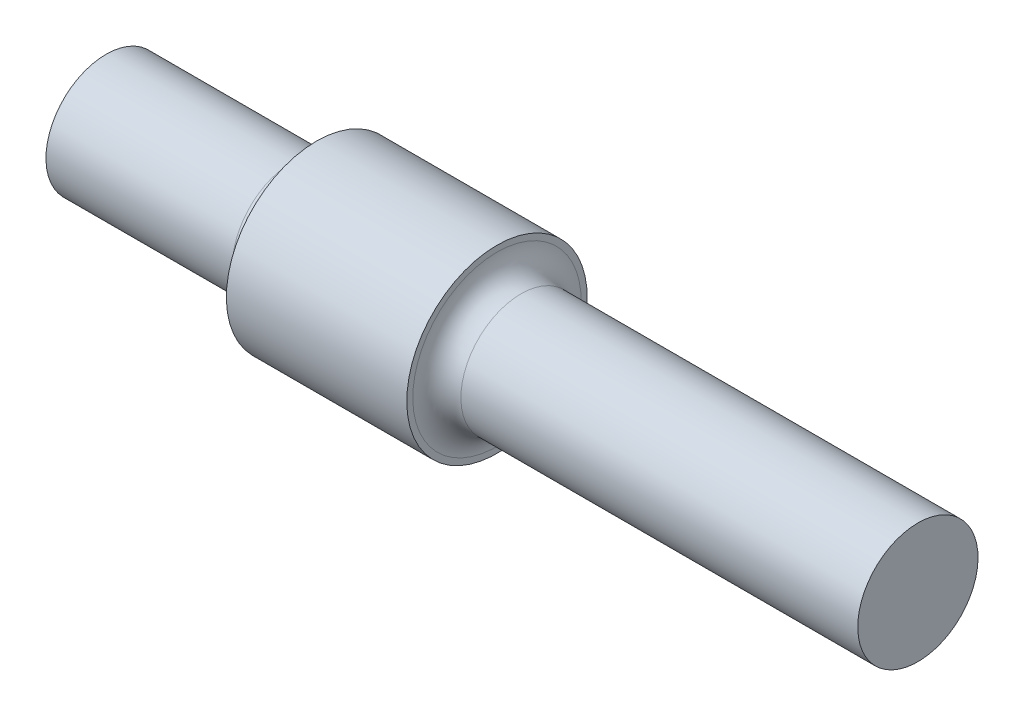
ISO-10303-21;
HEADER;
FILE_DESCRIPTION(('STEP AP214'),'2;1');
FILE_NAME('part.step','',(''),(''),'','','');
FILE_SCHEMA(('AUTOMOTIVE_DESIGN { 1 0 10303 214 1 1 1 1 }'));
ENDSEC;
DATA;
#1=APPLICATION_CONTEXT('core data for automotive mechanical design processes');
#2=APPLICATION_PROTOCOL_DEFINITION('international standard','automotive_design',2000,#1);
#3=PRODUCT_CONTEXT('',#1,'mechanical');
#4=PRODUCT('Part','Part','',(#3));
#5=PRODUCT_RELATED_PRODUCT_CATEGORY('part','',(#4));
#6=PRODUCT_DEFINITION_FORMATION('','',#4);
#7=PRODUCT_DEFINITION_CONTEXT('part definition',#1,'design');
#8=PRODUCT_DEFINITION('design','',#6,#7);
#9=PRODUCT_DEFINITION_SHAPE('','',#8);
#10=(LENGTH_UNIT() NAMED_UNIT(*) SI_UNIT(.MILLI.,.METRE.));
#11=(NAMED_UNIT(*) PLANE_ANGLE_UNIT() SI_UNIT($,.RADIAN.));
#12=(NAMED_UNIT(*) SI_UNIT($,.STERADIAN.) SOLID_ANGLE_UNIT());
#13=UNCERTAINTY_MEASURE_WITH_UNIT(LENGTH_MEASURE(1.E-05),#10,'distance_accuracy_value','');
#14=(GEOMETRIC_REPRESENTATION_CONTEXT(3) GLOBAL_UNCERTAINTY_ASSIGNED_CONTEXT((#13)) GLOBAL_UNIT_ASSIGNED_CONTEXT((#10,
#11,#12)) REPRESENTATION_CONTEXT('',''));
#15=CARTESIAN_POINT('',(0.,0.,0.));
#16=DIRECTION('',(0.,0.,1.));
#17=DIRECTION('',(1.,0.,0.));
#18=AXIS2_PLACEMENT_3D('',#15,#16,#17);
#19=CARTESIAN_POINT('',(135.,15.,0.));
#20=DIRECTION('',(1.,0.,0.));
#21=DIRECTION('',(0.,1.,0.));
#22=AXIS2_PLACEMENT_3D('',#19,#20,#21);
#23=CYLINDRICAL_SURFACE('',#22,15.);
#24=CARTESIAN_POINT('',(35.,15.,0.));
#25=DIRECTION('',(1.,0.,0.));
#26=DIRECTION('',(0.,1.,0.));
#27=AXIS2_PLACEMENT_3D('',#24,#25,#26);
#28=CIRCLE('',#27,15.);
#29=CARTESIAN_POINT('',(35.,30.,0.));
#30=VERTEX_POINT('',#29);
#31=EDGE_CURVE('E100',#30,#30,#28,.T.);
#32=ORIENTED_EDGE('',*,*,#31,.T.);
#33=EDGE_LOOP('',(#32));
#34=FACE_BOUND('',#33,.T.);
#35=CARTESIAN_POINT('',(65.,15.,0.));
#36=DIRECTION('',(1.,0.,0.));
#37=DIRECTION('',(0.,1.,0.));
#38=AXIS2_PLACEMENT_3D('',#35,#36,#37);
#39=CIRCLE('',#38,15.);
#40=CARTESIAN_POINT('',(65.,30.,0.));
#41=VERTEX_POINT('',#40);
#42=EDGE_CURVE('E92',#41,#41,#39,.T.);
#43=ORIENTED_EDGE('',*,*,#42,.F.);
#44=EDGE_LOOP('',(#43));
#45=FACE_BOUND('',#44,.T.);
#46=DIRECTION('',(1.,0.,0.));
#47=VECTOR('',#46,1.);
#48=CARTESIAN_POINT('',(135.,0.20980054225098,-2.5));
#49=LINE('',#48,#47);
#50=CARTESIAN_POINT('',(57.5,0.209800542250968,-2.5));
#51=VERTEX_POINT('',#50);
#52=CARTESIAN_POINT('',(42.5,0.209800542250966,-2.5));
#53=VERTEX_POINT('',#52);
#54=EDGE_CURVE('E11',#51,#53,#49,.F.);
#55=ORIENTED_EDGE('',*,*,#54,.T.);
#56=CARTESIAN_POINT('',(42.5,0.209800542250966,-2.5));
#57=CARTESIAN_POINT('',(42.4302056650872,0.209805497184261,-2.50000730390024));
#58=CARTESIAN_POINT('',(42.360415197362,0.209306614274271,-2.4970773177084));
#59=CARTESIAN_POINT('',(42.2213432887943,0.207337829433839,-2.4853993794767));
#60=CARTESIAN_POINT('',(42.1520617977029,0.205868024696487,-2.47665200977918));
#61=CARTESIAN_POINT('',(42.0145824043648,0.201996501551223,-2.45341067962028));
#62=CARTESIAN_POINT('',(41.9463832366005,0.199595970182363,-2.43892403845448));
#63=CARTESIAN_POINT('',(41.811482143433,0.193936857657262,-2.40432916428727));
#64=CARTESIAN_POINT('',(41.7447802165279,0.190678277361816,-2.38422093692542));
#65=CARTESIAN_POINT('',(41.5475936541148,0.179745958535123,-2.31565228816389));
#66=CARTESIAN_POINT('',(41.4199350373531,0.170912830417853,-2.25893203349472));
#67=CARTESIAN_POINT('',(41.1760128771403,0.1511582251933,-2.12519086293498));
#68=CARTESIAN_POINT('',(41.0597494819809,0.140236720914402,-2.04816968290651));
#69=CARTESIAN_POINT('',(40.8406979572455,0.11741594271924,-1.87519305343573));
#70=CARTESIAN_POINT('',(40.7380360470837,0.105508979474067,-1.77907849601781));
#71=CARTESIAN_POINT('',(40.5502132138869,0.0821262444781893,-1.57098216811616));
#72=CARTESIAN_POINT('',(40.465054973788,0.0706505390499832,-1.45899796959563));
#73=CARTESIAN_POINT('',(40.314183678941,0.0493423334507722,-1.2215195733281));
#74=CARTESIAN_POINT('',(40.2485893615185,0.0395200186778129,-1.09594894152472));
#75=CARTESIAN_POINT('',(40.1394763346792,0.0227122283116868,-0.83538789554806));
#76=CARTESIAN_POINT('',(40.0959549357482,0.0157264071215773,-0.700398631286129));
#77=CARTESIAN_POINT('',(40.0326078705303,0.00543271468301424,-0.426145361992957));
#78=CARTESIAN_POINT('',(40.0125675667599,0.002091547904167,-0.286932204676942));
#79=CARTESIAN_POINT('',(39.9960841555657,-0.000650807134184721,-0.00707863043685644));
#80=CARTESIAN_POINT('',(39.9996400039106,-5.2169746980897E-05,0.13356172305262));
#81=CARTESIAN_POINT('',(40.0300813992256,0.00499142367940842,0.410802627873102));
#82=CARTESIAN_POINT('',(40.0567353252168,0.00939819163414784,0.547429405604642));
#83=CARTESIAN_POINT('',(40.1322513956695,0.0215202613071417,0.814242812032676));
#84=CARTESIAN_POINT('',(40.1811140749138,0.0292356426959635,0.944429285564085));
#85=CARTESIAN_POINT('',(40.2998917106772,0.0471731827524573,1.19535848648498));
#86=CARTESIAN_POINT('',(40.3699024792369,0.057406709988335,1.31605501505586));
#87=CARTESIAN_POINT('',(40.5289162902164,0.0792430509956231,1.54406954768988));
#88=CARTESIAN_POINT('',(40.6179201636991,0.0908459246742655,1.65138696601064));
#89=CARTESIAN_POINT('',(40.8136646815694,0.114295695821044,1.85095740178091));
#90=CARTESIAN_POINT('',(40.9206055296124,0.126143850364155,1.94301399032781));
#91=CARTESIAN_POINT('',(41.1485556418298,0.148617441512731,2.10793451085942));
#92=CARTESIAN_POINT('',(41.2695689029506,0.159242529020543,2.18079297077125));
#93=CARTESIAN_POINT('',(41.5224736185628,0.178069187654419,2.30528815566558));
#94=CARTESIAN_POINT('',(41.6543831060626,0.18626663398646,2.35688881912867));
#95=CARTESIAN_POINT('',(41.9250742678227,0.199244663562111,2.43707184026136));
#96=CARTESIAN_POINT('',(42.0638453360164,0.20403035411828,2.46568861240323));
#97=CARTESIAN_POINT('',(42.2530597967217,0.207821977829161,2.48826986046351));
#98=CARTESIAN_POINT('',(42.3023859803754,0.208563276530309,2.49267049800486));
#99=CARTESIAN_POINT('',(42.4011342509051,0.209552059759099,2.49853173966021));
#100=CARTESIAN_POINT('',(42.4505560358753,0.209800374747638,2.49999728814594));
#101=CARTESIAN_POINT('',(42.5,0.209800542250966,2.5));
#102=B_SPLINE_CURVE_WITH_KNOTS('',3,(#56,#57,#58,#59,#60,#61,#62,#63,#64,#65,#66,#67,#68,#69,
#70,#71,#72,#73,#74,#75,#76,#77,#78,#79,#80,#81,#82,#83,#84,#85,#86,#87,#88,#89,#90,#91,#92,#93,
#94,#95,#96,#97,#98,#99,#100,#101),.UNSPECIFIED.,.F.,.F.,(4,2,2,2,2,2,2,2,2,2,2,2,2,2,2,2,2,2,2,
2,2,2,4),(0.,0.209312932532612,0.418604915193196,0.627630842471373,0.836656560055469,
1.25442781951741,1.67220451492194,2.09362084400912,2.51510171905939,2.93909089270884,
3.36302839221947,3.78305973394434,4.20307248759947,4.61892157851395,5.03478068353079,
5.45255285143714,5.87034330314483,6.29315203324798,6.71608114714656,7.13972478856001,
7.56273290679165,7.71124858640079,7.85951386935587),.UNSPECIFIED.);
#103=CARTESIAN_POINT('',(42.5,0.209800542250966,2.5));
#104=VERTEX_POINT('',#103);
#105=EDGE_CURVE('E118',#53,#104,#102,.T.);
#106=ORIENTED_EDGE('',*,*,#105,.T.);
#107=DIRECTION('',(1.,0.,0.));
#108=VECTOR('',#107,1.);
#109=CARTESIAN_POINT('',(135.,0.209800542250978,2.5));
#110=LINE('',#109,#108);
#111=CARTESIAN_POINT('',(57.5,0.209800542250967,2.5));
#112=VERTEX_POINT('',#111);
#113=EDGE_CURVE('E41',#104,#112,#110,.T.);
#114=ORIENTED_EDGE('',*,*,#113,.T.);
#115=CARTESIAN_POINT('',(57.5,0.209800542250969,2.5));
#116=CARTESIAN_POINT('',(57.5697943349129,0.209805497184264,2.50000730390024));
#117=CARTESIAN_POINT('',(57.639584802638,0.209306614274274,2.4970773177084));
#118=CARTESIAN_POINT('',(57.7786567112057,0.207337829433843,2.4853993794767));
#119=CARTESIAN_POINT('',(57.8479382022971,0.20586802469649,2.47665200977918));
#120=CARTESIAN_POINT('',(57.9854175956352,0.201996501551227,2.45341067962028));
#121=CARTESIAN_POINT('',(58.0536167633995,0.199595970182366,2.43892403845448));
#122=CARTESIAN_POINT('',(58.188517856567,0.193936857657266,2.40432916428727));
#123=CARTESIAN_POINT('',(58.2552197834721,0.19067827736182,2.38422093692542));
#124=CARTESIAN_POINT('',(58.4524063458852,0.179745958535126,2.31565228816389));
#125=CARTESIAN_POINT('',(58.5800649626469,0.170912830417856,2.25893203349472));
#126=CARTESIAN_POINT('',(58.8239871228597,0.151158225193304,2.12519086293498));
#127=CARTESIAN_POINT('',(58.9402505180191,0.140236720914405,2.04816968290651));
#128=CARTESIAN_POINT('',(59.1593020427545,0.117415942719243,1.87519305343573));
#129=CARTESIAN_POINT('',(59.2619639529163,0.105508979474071,1.77907849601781));
#130=CARTESIAN_POINT('',(59.4497867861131,0.0821262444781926,1.57098216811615));
#131=CARTESIAN_POINT('',(59.534945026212,0.0706505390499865,1.45899796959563));
#132=CARTESIAN_POINT('',(59.685816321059,0.0493423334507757,1.2215195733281));
#133=CARTESIAN_POINT('',(59.7514106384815,0.0395200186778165,1.09594894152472));
#134=CARTESIAN_POINT('',(59.8605236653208,0.0227122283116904,0.835387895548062));
#135=CARTESIAN_POINT('',(59.9040450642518,0.0157264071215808,0.70039863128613));
#136=CARTESIAN_POINT('',(59.9673921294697,0.0054327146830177,0.426145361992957));
#137=CARTESIAN_POINT('',(59.9874324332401,0.00209154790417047,0.286932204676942));
#138=CARTESIAN_POINT('',(60.0039158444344,-0.000650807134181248,0.00707863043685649));
#139=CARTESIAN_POINT('',(60.0003599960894,-5.21697469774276E-05,-0.13356172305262));
#140=CARTESIAN_POINT('',(59.9699186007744,0.00499142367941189,-0.410802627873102));
#141=CARTESIAN_POINT('',(59.9432646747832,0.00939819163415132,-0.547429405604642));
#142=CARTESIAN_POINT('',(59.8677486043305,0.0215202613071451,-0.814242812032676));
#143=CARTESIAN_POINT('',(59.8188859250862,0.029235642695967,-0.944429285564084));
#144=CARTESIAN_POINT('',(59.7001082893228,0.0471731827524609,-1.19535848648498));
#145=CARTESIAN_POINT('',(59.6300975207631,0.0574067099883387,-1.31605501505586));
#146=CARTESIAN_POINT('',(59.4710837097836,0.0792430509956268,-1.54406954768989));
#147=CARTESIAN_POINT('',(59.3820798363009,0.0908459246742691,-1.65138696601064));
#148=CARTESIAN_POINT('',(59.1863353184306,0.114295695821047,-1.85095740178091));
#149=CARTESIAN_POINT('',(59.0793944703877,0.126143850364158,-1.94301399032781));
#150=CARTESIAN_POINT('',(58.8514443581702,0.148617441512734,-2.10793451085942));
#151=CARTESIAN_POINT('',(58.7304310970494,0.159242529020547,-2.18079297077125));
#152=CARTESIAN_POINT('',(58.4775263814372,0.178069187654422,-2.30528815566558));
#153=CARTESIAN_POINT('',(58.3456168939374,0.186266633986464,-2.35688881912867));
#154=CARTESIAN_POINT('',(58.0749257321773,0.199244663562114,-2.43707184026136));
#155=CARTESIAN_POINT('',(57.9361546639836,0.204030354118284,-2.46568861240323));
#156=CARTESIAN_POINT('',(57.7469402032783,0.207821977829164,-2.48826986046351));
#157=CARTESIAN_POINT('',(57.6976140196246,0.208563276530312,-2.49267049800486));
#158=CARTESIAN_POINT('',(57.5988657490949,0.209552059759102,-2.49853173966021));
#159=CARTESIAN_POINT('',(57.5494439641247,0.209800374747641,-2.49999728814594));
#160=CARTESIAN_POINT('',(57.5,0.209800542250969,-2.5));
#161=B_SPLINE_CURVE_WITH_KNOTS('',3,(#115,#116,#117,#118,#119,#120,#121,#122,#123,#124,#125,
#126,#127,#128,#129,#130,#131,#132,#133,#134,#135,#136,#137,#138,#139,#140,#141,#142,#143,#144,
#145,#146,#147,#148,#149,#150,#151,#152,#153,#154,#155,#156,#157,#158,#159,#160),.UNSPECIFIED.,
.F.,.F.,(4,2,2,2,2,2,2,2,2,2,2,2,2,2,2,2,2,2,2,2,2,2,4),(0.,0.209312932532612,0.418604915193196,
0.627630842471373,0.836656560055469,1.25442781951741,1.67220451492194,2.09362084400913,
2.51510171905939,2.93909089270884,3.36302839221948,3.78305973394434,4.20307248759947,
4.61892157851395,5.03478068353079,5.45255285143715,5.87034330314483,6.29315203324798,
6.71608114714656,7.13972478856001,7.56273290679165,7.7112485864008,7.85951386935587),.UNSPECIFIED.);
#162=EDGE_CURVE('E48',#112,#51,#161,.T.);
#163=ORIENTED_EDGE('',*,*,#162,.T.);
#164=EDGE_LOOP('',(#55,#106,#114,#163));
#165=FACE_BOUND('',#164,.T.);
#166=ADVANCED_FACE('F33',(#34,#45,#165),#23,.T.);
#167=CARTESIAN_POINT('',(0.,15.,0.));
#168=DIRECTION('',(-1.,0.,0.));
#169=DIRECTION('',(0.,-1.,0.));
#170=AXIS2_PLACEMENT_3D('',#167,#168,#169);
#171=PLANE('',#170);
#172=CARTESIAN_POINT('',(0.,15.,0.));
#173=DIRECTION('',(1.,0.,0.));
#174=DIRECTION('',(0.,1.,0.));
#175=AXIS2_PLACEMENT_3D('',#172,#173,#174);
#176=CIRCLE('',#175,10.);
#177=CARTESIAN_POINT('',(0.,25.,0.));
#178=VERTEX_POINT('',#177);
#179=EDGE_CURVE('E103',#178,#178,#176,.T.);
#180=ORIENTED_EDGE('',*,*,#179,.F.);
#181=EDGE_LOOP('',(#180));
#182=FACE_BOUND('',#181,.T.);
#183=ADVANCED_FACE('F166',(#182),#171,.T.);
#184=CARTESIAN_POINT('',(135.,15.,0.));
#185=DIRECTION('',(1.,0.,0.));
#186=DIRECTION('',(0.,1.,0.));
#187=AXIS2_PLACEMENT_3D('',#184,#185,#186);
#188=CYLINDRICAL_SURFACE('',#187,10.);
#189=CARTESIAN_POINT('',(31.,15.,0.));
#190=DIRECTION('',(-1.,0.,0.));
#191=DIRECTION('',(0.,-1.,0.));
#192=AXIS2_PLACEMENT_3D('',#189,#190,#191);
#193=CIRCLE('',#192,10.);
#194=CARTESIAN_POINT('',(31.,5.,0.));
#195=VERTEX_POINT('',#194);
#196=EDGE_CURVE('E115',#195,#195,#193,.T.);
#197=ORIENTED_EDGE('',*,*,#196,.T.);
#198=EDGE_LOOP('',(#197));
#199=FACE_BOUND('',#198,.T.);
#200=ORIENTED_EDGE('',*,*,#179,.T.);
#201=EDGE_LOOP('',(#200));
#202=FACE_BOUND('',#201,.T.);
#203=ADVANCED_FACE('F162',(#199,#202),#188,.T.);
#204=CARTESIAN_POINT('',(35.,25.,0.));
#205=DIRECTION('',(-1.,0.,0.));
#206=DIRECTION('',(0.,-1.,0.));
#207=AXIS2_PLACEMENT_3D('',#204,#205,#206);
#208=PLANE('',#207);
#209=CARTESIAN_POINT('',(35.,15.,0.));
#210=DIRECTION('',(-1.,0.,0.));
#211=DIRECTION('',(0.,-1.,0.));
#212=AXIS2_PLACEMENT_3D('',#209,#210,#211);
#213=CIRCLE('',#212,14.);
#214=CARTESIAN_POINT('',(35.,1.,0.));
#215=VERTEX_POINT('',#214);
#216=EDGE_CURVE('E112',#215,#215,#213,.F.);
#217=ORIENTED_EDGE('',*,*,#216,.T.);
#218=EDGE_LOOP('',(#217));
#219=FACE_BOUND('',#218,.T.);
#220=ORIENTED_EDGE('',*,*,#31,.F.);
#221=EDGE_LOOP('',(#220));
#222=FACE_BOUND('',#221,.T.);
#223=ADVANCED_FACE('F157',(#219,#222),#208,.T.);
#224=CARTESIAN_POINT('',(65.,30.,0.));
#225=DIRECTION('',(1.,0.,0.));
#226=DIRECTION('',(0.,1.,0.));
#227=AXIS2_PLACEMENT_3D('',#224,#225,#226);
#228=PLANE('',#227);
#229=CARTESIAN_POINT('',(65.,15.,0.));
#230=DIRECTION('',(1.,0.,0.));
#231=DIRECTION('',(0.,1.,0.));
#232=AXIS2_PLACEMENT_3D('',#229,#230,#231);
#233=CIRCLE('',#232,14.);
#234=CARTESIAN_POINT('',(65.,29.,0.));
#235=VERTEX_POINT('',#234);
#236=EDGE_CURVE('E109',#235,#235,#233,.F.);
#237=ORIENTED_EDGE('',*,*,#236,.T.);
#238=EDGE_LOOP('',(#237));
#239=FACE_BOUND('',#238,.T.);
#240=ORIENTED_EDGE('',*,*,#42,.T.);
#241=EDGE_LOOP('',(#240));
#242=FACE_BOUND('',#241,.T.);
#243=ADVANCED_FACE('F154',(#239,#242),#228,.T.);
#244=CARTESIAN_POINT('',(135.,15.,0.));
#245=DIRECTION('',(1.,0.,0.));
#246=DIRECTION('',(0.,1.,0.));
#247=AXIS2_PLACEMENT_3D('',#244,#245,#246);
#248=CYLINDRICAL_SURFACE('',#247,9.99999999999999);
#249=CARTESIAN_POINT('',(69.,15.,0.));
#250=DIRECTION('',(1.,0.,0.));
#251=DIRECTION('',(0.,1.,0.));
#252=AXIS2_PLACEMENT_3D('',#249,#250,#251);
#253=CIRCLE('',#252,9.99999999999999);
#254=CARTESIAN_POINT('',(69.,25.,0.));
#255=VERTEX_POINT('',#254);
#256=EDGE_CURVE('E106',#255,#255,#253,.T.);
#257=ORIENTED_EDGE('',*,*,#256,.T.);
#258=EDGE_LOOP('',(#257));
#259=FACE_BOUND('',#258,.T.);
#260=CARTESIAN_POINT('',(135.,15.,0.));
#261=DIRECTION('',(1.,0.,0.));
#262=DIRECTION('',(0.,1.,0.));
#263=AXIS2_PLACEMENT_3D('',#260,#261,#262);
#264=CIRCLE('',#263,9.99999999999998);
#265=CARTESIAN_POINT('',(135.,25.,0.));
#266=VERTEX_POINT('',#265);
#267=EDGE_CURVE('E88',#266,#266,#264,.T.);
#268=ORIENTED_EDGE('',*,*,#267,.F.);
#269=EDGE_LOOP('',(#268));
#270=FACE_BOUND('',#269,.T.);
#271=ADVANCED_FACE('F151',(#259,#270),#248,.T.);
#272=CARTESIAN_POINT('',(135.,25.,0.));
#273=DIRECTION('',(1.,0.,0.));
#274=DIRECTION('',(0.,1.,0.));
#275=AXIS2_PLACEMENT_3D('',#272,#273,#274);
#276=PLANE('',#275);
#277=ORIENTED_EDGE('',*,*,#267,.T.);
#278=EDGE_LOOP('',(#277));
#279=FACE_BOUND('',#278,.T.);
#280=ADVANCED_FACE('F147',(#279),#276,.T.);
#281=CARTESIAN_POINT('',(69.,15.,0.));
#282=DIRECTION('',(1.,0.,0.));
#283=DIRECTION('',(0.,1.,0.));
#284=AXIS2_PLACEMENT_3D('',#281,#282,#283);
#285=TOROIDAL_SURFACE('',#284,14.,4.);
#286=ORIENTED_EDGE('',*,*,#236,.F.);
#287=EDGE_LOOP('',(#286));
#288=FACE_BOUND('',#287,.T.);
#289=ORIENTED_EDGE('',*,*,#256,.F.);
#290=EDGE_LOOP('',(#289));
#291=FACE_BOUND('',#290,.T.);
#292=ADVANCED_FACE('F150',(#288,#291),#285,.F.);
#293=CARTESIAN_POINT('',(31.,15.,0.));
#294=DIRECTION('',(-1.,0.,0.));
#295=DIRECTION('',(0.,-1.,0.));
#296=AXIS2_PLACEMENT_3D('',#293,#294,#295);
#297=TOROIDAL_SURFACE('',#296,14.,4.);
#298=ORIENTED_EDGE('',*,*,#196,.F.);
#299=EDGE_LOOP('',(#298));
#300=FACE_BOUND('',#299,.T.);
#301=ORIENTED_EDGE('',*,*,#216,.F.);
#302=EDGE_LOOP('',(#301));
#303=FACE_BOUND('',#302,.T.);
#304=ADVANCED_FACE('F35',(#300,#303),#297,.F.);
#305=CARTESIAN_POINT('',(57.5,2.5,0.));
#306=DIRECTION('',(0.,-1.,0.));
#307=DIRECTION('',(0.,0.,-1.));
#308=AXIS2_PLACEMENT_3D('',#305,#306,#307);
#309=CYLINDRICAL_SURFACE('',#308,2.5);
#310=DIRECTION('',(0.,-1.,0.));
#311=VECTOR('',#310,1.);
#312=CARTESIAN_POINT('',(57.5,2.5,2.5));
#313=LINE('',#312,#311);
#314=CARTESIAN_POINT('',(57.5,2.5,2.5));
#315=VERTEX_POINT('',#314);
#316=EDGE_CURVE('E85',#315,#112,#313,.T.);
#317=ORIENTED_EDGE('',*,*,#316,.F.);
#318=CARTESIAN_POINT('',(57.5,2.5,0.));
#319=DIRECTION('',(0.,1.,0.));
#320=DIRECTION('',(0.,0.,1.));
#321=AXIS2_PLACEMENT_3D('',#318,#319,#320);
#322=CIRCLE('',#321,2.5);
#323=CARTESIAN_POINT('',(57.5,2.5,-2.5));
#324=VERTEX_POINT('',#323);
#325=EDGE_CURVE('E79',#315,#324,#322,.T.);
#326=ORIENTED_EDGE('',*,*,#325,.T.);
#327=DIRECTION('',(0.,-1.,0.));
#328=VECTOR('',#327,1.);
#329=CARTESIAN_POINT('',(57.5,2.5,-2.5));
#330=LINE('',#329,#328);
#331=EDGE_CURVE('E84',#324,#51,#330,.T.);
#332=ORIENTED_EDGE('',*,*,#331,.T.);
#333=ORIENTED_EDGE('',*,*,#162,.F.);
#334=EDGE_LOOP('',(#317,#326,#332,#333));
#335=FACE_BOUND('',#334,.T.);
#336=ADVANCED_FACE('F83',(#335),#309,.F.);
#337=CARTESIAN_POINT('',(57.5,2.5,-2.5));
#338=DIRECTION('',(0.,0.,1.));
#339=DIRECTION('',(1.,0.,0.));
#340=AXIS2_PLACEMENT_3D('',#337,#338,#339);
#341=PLANE('',#340);
#342=ORIENTED_EDGE('',*,*,#331,.F.);
#343=DIRECTION('',(-1.,0.,0.));
#344=VECTOR('',#343,1.);
#345=CARTESIAN_POINT('',(57.5,2.5,-2.5));
#346=LINE('',#345,#344);
#347=CARTESIAN_POINT('',(42.5,2.5,-2.5));
#348=VERTEX_POINT('',#347);
#349=EDGE_CURVE('E75',#324,#348,#346,.T.);
#350=ORIENTED_EDGE('',*,*,#349,.T.);
#351=DIRECTION('',(0.,-1.,0.));
#352=VECTOR('',#351,1.);
#353=CARTESIAN_POINT('',(42.5,2.5,-2.5));
#354=LINE('',#353,#352);
#355=EDGE_CURVE('E89',#348,#53,#354,.T.);
#356=ORIENTED_EDGE('',*,*,#355,.T.);
#357=ORIENTED_EDGE('',*,*,#54,.F.);
#358=EDGE_LOOP('',(#342,#350,#356,#357));
#359=FACE_BOUND('',#358,.T.);
#360=ADVANCED_FACE('F87',(#359),#341,.T.);
#361=CARTESIAN_POINT('',(42.5,2.5,0.));
#362=DIRECTION('',(0.,-1.,0.));
#363=DIRECTION('',(0.,0.,-1.));
#364=AXIS2_PLACEMENT_3D('',#361,#362,#363);
#365=CYLINDRICAL_SURFACE('',#364,2.5);
#366=ORIENTED_EDGE('',*,*,#355,.F.);
#367=CARTESIAN_POINT('',(42.5,2.5,0.));
#368=DIRECTION('',(0.,1.,0.));
#369=DIRECTION('',(0.,0.,1.));
#370=AXIS2_PLACEMENT_3D('',#367,#368,#369);
#371=CIRCLE('',#370,2.5);
#372=CARTESIAN_POINT('',(42.5,2.5,2.5));
#373=VERTEX_POINT('',#372);
#374=EDGE_CURVE('E80',#348,#373,#371,.T.);
#375=ORIENTED_EDGE('',*,*,#374,.T.);
#376=DIRECTION('',(0.,-1.,0.));
#377=VECTOR('',#376,1.);
#378=CARTESIAN_POINT('',(42.5,2.5,2.5));
#379=LINE('',#378,#377);
#380=EDGE_CURVE('E94',#373,#104,#379,.T.);
#381=ORIENTED_EDGE('',*,*,#380,.T.);
#382=ORIENTED_EDGE('',*,*,#105,.F.);
#383=EDGE_LOOP('',(#366,#375,#381,#382));
#384=FACE_BOUND('',#383,.T.);
#385=ADVANCED_FACE('F135',(#384),#365,.F.);
#386=CARTESIAN_POINT('',(42.5,2.5,2.5));
#387=DIRECTION('',(0.,0.,-1.));
#388=DIRECTION('',(-1.,0.,0.));
#389=AXIS2_PLACEMENT_3D('',#386,#387,#388);
#390=PLANE('',#389);
#391=ORIENTED_EDGE('',*,*,#380,.F.);
#392=DIRECTION('',(1.,0.,0.));
#393=VECTOR('',#392,1.);
#394=CARTESIAN_POINT('',(42.5,2.5,2.5));
#395=LINE('',#394,#393);
#396=EDGE_CURVE('E181',#373,#315,#395,.T.);
#397=ORIENTED_EDGE('',*,*,#396,.T.);
#398=ORIENTED_EDGE('',*,*,#316,.T.);
#399=ORIENTED_EDGE('',*,*,#113,.F.);
#400=EDGE_LOOP('',(#391,#397,#398,#399));
#401=FACE_BOUND('',#400,.T.);
#402=ADVANCED_FACE('F140',(#401),#390,.T.);
#403=CARTESIAN_POINT('',(57.5,2.5,0.));
#404=DIRECTION('',(0.,1.,0.));
#405=DIRECTION('',(0.,0.,1.));
#406=AXIS2_PLACEMENT_3D('',#403,#404,#405);
#407=PLANE('',#406);
#408=ORIENTED_EDGE('',*,*,#325,.F.);
#409=ORIENTED_EDGE('',*,*,#396,.F.);
#410=ORIENTED_EDGE('',*,*,#374,.F.);
#411=ORIENTED_EDGE('',*,*,#349,.F.);
#412=EDGE_LOOP('',(#408,#409,#410,#411));
#413=FACE_BOUND('',#412,.T.);
#414=ADVANCED_FACE('F77',(#413),#407,.F.);
#415=CLOSED_SHELL('',(#166,#183,#203,#223,#243,#271,#280,#292,#304,#336,#360,#385,#402,#414));
#416=MANIFOLD_SOLID_BREP('B2',#415);
#417=ADVANCED_BREP_SHAPE_REPRESENTATION('',(#18,#416),#14);
#418=SHAPE_DEFINITION_REPRESENTATION(#9,#417);
ENDSEC;
END-ISO-10303-21;
